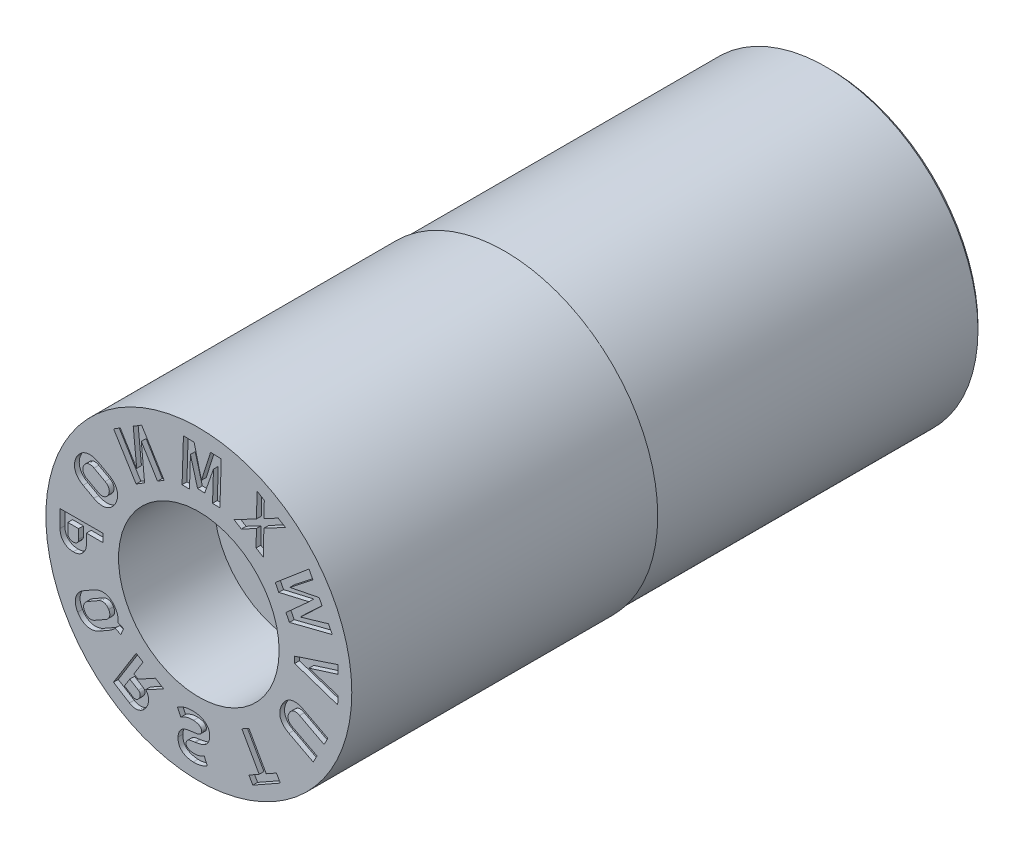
from build123d import *

# Parameters (mm, degrees)
SKETCH4_W          = 17
SKETCH4_H          = 1
CUT_EXTRUDE1_DEPTH = 0.25
CUT_EXTRUDE2_DEPTH = 4


with BuildPart() as part:
    # Sketch1 → Revolve1 (revolve)
    with BuildSketch(Plane(origin=(0, 0, 0), x_dir=(0, 0, -1), z_dir=(1, 0, 0)), mode=Mode.PRIVATE) as revolve1_sk:
        Polygon((0, 8), (0, 4.2), (5, 4.2), (5, 1.75), (25, 1.75), (25, 4), (33, 4), (33, 7.75), (32.75, 8), align=None)
    revolve(revolve1_sk.sketch.rotate(Axis((0, 0, 3.797909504), (0, 0, -1)), 90), axis=Axis((0, 0, 3.797909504), (0, 0, -1)))

    # Sketch4 → Cut-Revolve1 (revolve, cut)
    with BuildSketch(Plane(origin=(0, 0, 0), x_dir=(0, 0, -1), z_dir=(1, 0, 0)), mode=Mode.PRIVATE) as cut_revolve1_sk:
        with Locations((24.5, 8.435)):
            Rectangle(SKETCH4_W, SKETCH4_H)
    revolve(cut_revolve1_sk.sketch.rotate(Axis((0, 0, 0), (0, 0, -1)), 90), axis=Axis((0, 0, 0), (0, 0, -1)), mode=Mode.SUBTRACT)

    # Sketch2 → Cut-Extrude1 (cut)
    # profile 1 of 12: a face of its own
    with BuildSketch(Plane.XY):
        Polygon((6.448754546, 3.151683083), (6.292730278, 3.45458414), (4.760102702, 3.149735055), (5.963079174, 4.094985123), (5.76320825, 4.483422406), (3.998484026, 2.990849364), (4.181338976, 2.635462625), (5.763476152, 3.000881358), (4.555957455, 1.908724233), (4.738812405, 1.553337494), (6.978276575, 2.122844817), (6.778405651, 2.5112821), (5.310107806, 2.080851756), align=None)
    # profile 2 of 12: a face of its own
    with BuildSketch(Plane.XY):
        Polygon((3.156279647, -6.117715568), (2.621254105, -6.419287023), (2.82217294, -6.775881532), (4.261475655, -5.964606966), (4.060556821, -5.608012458), (3.525899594, -5.909376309), (2.620321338, -4.302326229), (2.250802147, -4.51084429), align=None)
    # profile 3 of 12: a face of its own
    with BuildSketch(Plane.XY):
        Polygon((3.400422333, 5.14887687), (4.531800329, 5.749930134), (4.150411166, 5.982356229), (3.408333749, 5.588339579), (3.423618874, 6.425440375), (3.042019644, 6.658274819), (3.018723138, 5.380163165), (1.84224823, 4.756236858), (2.22384746, 4.523402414), (3.010860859, 4.942038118), (2.995108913, 4.053102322), (3.376708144, 3.820267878), align=None)
    # profile 4 of 12: a face of its own
    with BuildSketch(Plane.XY):
        with BuildLine():
            Line((-3.176893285, -4.977699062), (-3.394354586, -4.842178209))
            Line((-3.394354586, -4.842178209), (-2.916705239, -4.075545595))
            Line((-2.916705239, -4.075545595), (-3.275682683, -3.851806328))
            Line((-3.275682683, -3.851806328), (-4.463186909, -5.757764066))
            Line((-4.463186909, -5.757764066), (-3.629212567, -6.277720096))
            add(Edge.make_bspline(
                [(-3.629212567, -6.277720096), (-3.579366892, -6.308192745), (-3.50124317, -6.347048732), (-3.390455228, -6.373239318), (-3.308726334, -6.381238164), (-3.227782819, -6.377355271), (-3.148482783, -6.36164209), (-3.07152402, -6.334571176), (-2.997611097, -6.295599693), (-2.926800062, -6.246575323), (-2.837796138, -6.163751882), (-2.780297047, -6.090431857), (-2.747646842, -6.036315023)],
                knots=[0, 0, 0, 0, 0.170748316, 0.251496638, 0.330740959, 0.409455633, 0.486885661, 0.565662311, 0.646450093, 0.72982964, 0.816027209, 1, 1, 1, 1], degree=3))
            add(Edge.make_bspline(
                [(-2.747646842, -6.036315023), (-2.714781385, -5.982423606), (-2.671434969, -5.899480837), (-2.638108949, -5.782361), (-2.624135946, -5.697139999), (-2.622456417, -5.613312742), (-2.631378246, -5.531928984), (-2.652957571, -5.454059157), (-2.685481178, -5.379711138), (-2.72771268, -5.311465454), (-2.761562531, -5.270255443), (-2.779240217, -5.251415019)],
                knots=[0, 0, 0, 0, 0.184404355, 0.270267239, 0.35397279, 0.435404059, 0.513884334, 0.591753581, 0.669953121, 0.749645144, 0.824899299, 0.824899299, 0.824899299, 0.824899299], degree=3))
            Line((-2.779240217, -5.251415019), (-1.834621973, -4.74981579))
            Line((-1.834621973, -4.74981579), (-2.269640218, -4.478640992))
            Line((-2.269640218, -4.478640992), (-3.176893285, -4.977699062))
        make_face()
        with BuildLine():
            Line((-3.609739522, -5.187873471), (-3.163352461, -5.466016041))
            add(Edge.make_bspline(
                [(-3.163352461, -5.466016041), (-3.145800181, -5.4768042), (-3.121786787, -5.496107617), (-3.097044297, -5.528052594), (-3.083002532, -5.553932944), (-3.072734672, -5.581604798), (-3.065841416, -5.610816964), (-3.064735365, -5.641794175), (-3.066809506, -5.673836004), (-3.073784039, -5.706486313), (-3.087507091, -5.752072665), (-3.104200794, -5.784772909), (-3.117133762, -5.806061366)],
                knots=[0, 0, 0, 0, 0.160612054, 0.237098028, 0.313463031, 0.389060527, 0.466580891, 0.546138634, 0.629588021, 0.716198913, 0.805605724, 1, 1, 1, 1], degree=3))
            add(Edge.make_bspline(
                [(-3.117133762, -5.806061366), (-3.129717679, -5.827405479), (-3.152489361, -5.855740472), (-3.185771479, -5.88946938), (-3.21234139, -5.909579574), (-3.240003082, -5.925553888), (-3.268125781, -5.938236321), (-3.297355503, -5.945494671), (-3.326744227, -5.948729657), (-3.356407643, -5.946866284), (-3.396414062, -5.93848117), (-3.424753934, -5.924977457), (-3.442466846, -5.913810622)],
                knots=[0, 0, 0, 0, 0.191933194, 0.281905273, 0.36782532, 0.450097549, 0.529993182, 0.606814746, 0.683303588, 0.759047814, 0.836940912, 1, 1, 1, 1], degree=3))
            Line((-3.442466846, -5.913810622), (-3.888769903, -5.635720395))
            Line((-3.888769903, -5.635720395), (-3.609739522, -5.187873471))
        make_face(mode=Mode.SUBTRACT)
    # profile 5 of 12: a face of its own
    with BuildSketch(Plane.XY):
        Polygon((-0.245141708, 7.220416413), (-0.804769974, 7.237854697), (-0.874340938, 4.985077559), (-0.488230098, 4.973391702), (-0.438783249, 6.571851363), (-0.065302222, 5.211328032), (0.309778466, 5.19975263), (0.765980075, 6.508322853), (0.717338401, 4.935891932), (1.102990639, 4.924229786), (1.172561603, 7.177006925), (0.613368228, 7.193962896), (0.137357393, 5.689187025), align=None)
    # profile 6 of 12: a face of its own
    with BuildSketch(Plane.XY):
        with BuildLine():
            Line((-5.879741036, 0.288959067), (-5.005414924, 0.290744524))
            Line((-5.005414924, 0.290744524), (-5.006376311, 0.71551886))
            Line((-5.006376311, 0.71551886), (-7.259749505, 0.710917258))
            Line((-7.259749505, 0.710917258), (-7.257987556, -0.192820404))
            add(Edge.make_bspline(
                [(-7.257987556, -0.192820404), (-7.258290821, -0.259485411), (-7.247448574, -0.357278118), (-7.211422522, -0.480537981), (-7.173532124, -0.563868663), (-7.125738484, -0.639549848), (-7.06903602, -0.70704663), (-7.003075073, -0.765047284), (-6.929071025, -0.814037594), (-6.847204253, -0.852638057), (-6.726663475, -0.890354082), (-6.630288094, -0.899112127), (-6.565264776, -0.899421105)],
                knots=[0, 0, 0, 0, 0.179427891, 0.26319197, 0.344951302, 0.425148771, 0.503595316, 0.581560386, 0.660921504, 0.741878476, 0.824547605, 1, 1, 1, 1], degree=3))
            add(Edge.make_bspline(
                [(-6.565264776, -0.899421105), (-6.500260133, -0.899222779), (-6.4041722, -0.889858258), (-6.284298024, -0.851423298), (-6.203396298, -0.812166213), (-6.129713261, -0.763391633), (-6.064142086, -0.705325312), (-6.007988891, -0.637480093), (-5.961210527, -0.561221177), (-5.923870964, -0.477540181), (-5.887488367, -0.354339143), (-5.878804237, -0.256216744), (-5.878962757, -0.189818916)],
                knots=[0, 0, 0, 0, 0.175670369, 0.257978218, 0.338538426, 0.417594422, 0.495742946, 0.574022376, 0.654372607, 0.736457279, 0.820616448, 1, 1, 1, 1], degree=3))
            Line((-5.878962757, -0.189818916), (-5.879741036, 0.288959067))
        make_face()
        with BuildLine():
            Line((-6.28888924, 0.288123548), (-6.288065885, -0.201256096))
            add(Edge.make_bspline(
                [(-6.288065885, -0.201256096), (-6.28811712, -0.225317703), (-6.29160305, -0.261103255), (-6.30635888, -0.305632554), (-6.321582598, -0.33597866), (-6.340687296, -0.363660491), (-6.363593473, -0.388253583), (-6.390327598, -0.409452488), (-6.420357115, -0.427320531), (-6.45341484, -0.441800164), (-6.501866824, -0.455813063), (-6.540281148, -0.45950966), (-6.566309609, -0.459492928)],
                knots=[0, 0, 0, 0, 0.169434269, 0.250085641, 0.328531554, 0.407345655, 0.485754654, 0.563904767, 0.646401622, 0.730758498, 0.816935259, 1, 1, 1, 1], degree=3))
            add(Edge.make_bspline(
                [(-6.566309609, -0.459492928), (-6.59263734, -0.459791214), (-6.631548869, -0.456536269), (-6.680751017, -0.443036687), (-6.714342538, -0.429056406), (-6.744663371, -0.411392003), (-6.771637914, -0.390504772), (-6.794803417, -0.366155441), (-6.814323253, -0.338598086), (-6.829775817, -0.308238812), (-6.844425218, -0.263111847), (-6.848481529, -0.227045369), (-6.84876811, -0.202506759)],
                knots=[0, 0, 0, 0, 0.183737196, 0.270259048, 0.354930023, 0.436774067, 0.514305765, 0.592094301, 0.670284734, 0.749063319, 0.828741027, 1, 1, 1, 1], degree=3))
            Line((-6.84876811, -0.202506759), (-6.849591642, 0.28697854))
            Line((-6.849591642, 0.28697854), (-6.28888924, 0.288123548))
        make_face(mode=Mode.SUBTRACT)
    # profile 7 of 12: a face of its own
    with BuildSketch(Plane.XY):
        Polygon((-2.989519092, 6.623957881), (-3.430480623, 6.353029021), (-3.24985543, 4.534367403), (-4.110336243, 5.935151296), (-4.455080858, 5.723065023), (-3.280328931, 3.811320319), (-2.836850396, 4.084025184), (-3.006866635, 5.879968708), (-2.15929458, 4.500531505), (-1.814767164, 4.712213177), align=None)
    # profile 8 of 12: a face of its own
    with BuildSketch(Plane.XY):
        with BuildLine():
            Line((-4.697997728, 3.50761804), (-5.259273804, 3.815458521))
            add(Edge.make_bspline(
                [(-5.259273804, 3.815458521), (-5.294785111, 3.834386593), (-5.348108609, 3.861485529), (-5.421785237, 3.888528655), (-5.47591246, 3.90572524), (-5.53009647, 3.918898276), (-5.584171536, 3.92872064), (-5.638158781, 3.933946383), (-5.691819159, 3.936536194), (-5.744886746, 3.934170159), (-5.797141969, 3.929852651), (-5.848233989, 3.920364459), (-5.898340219, 3.908007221), (-5.947513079, 3.892088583), (-5.995306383, 3.872142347), (-6.042475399, 3.849473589), (-6.088007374, 3.822324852), (-6.131911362, 3.791944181), (-6.174611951, 3.758936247), (-6.214770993, 3.722131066), (-6.253216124, 3.682306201), (-6.289625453, 3.63932919), (-6.336111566, 3.577140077), (-6.367075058, 3.526955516), (-6.386178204, 3.492126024)],
                knots=[0, 0, 0, 0, 0.091509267, 0.135459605, 0.178154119, 0.220454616, 0.262041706, 0.302877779, 0.343583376, 0.383954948, 0.42345463, 0.462585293, 0.501839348, 0.540633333, 0.579850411, 0.619400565, 0.659411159, 0.700116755, 0.740631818, 0.781903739, 0.823734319, 0.866298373, 0.909761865, 1, 1, 1, 1], degree=3))
            add(Edge.make_bspline(
                [(-6.386178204, 3.492126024), (-6.405624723, 3.457356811), (-6.43099495, 3.404032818), (-6.458416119, 3.331348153), (-6.474776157, 3.277540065), (-6.488332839, 3.223990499), (-6.496813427, 3.170117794), (-6.502538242, 3.116480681), (-6.504253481, 3.062882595), (-6.50257681, 3.009861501), (-6.496413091, 2.95779221), (-6.48752227, 2.9068268), (-6.474770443, 2.856873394), (-6.458283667, 2.808009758), (-6.437930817, 2.760321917), (-6.41484768, 2.713221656), (-6.386996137, 2.667987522), (-6.356905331, 2.623453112), (-6.322407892, 2.581512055), (-6.285807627, 2.540486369), (-6.245054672, 2.502294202), (-6.202027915, 2.465146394), (-6.138715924, 2.418640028), (-6.087874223, 2.387394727), (-6.052601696, 2.36795257)],
                knots=[0, 0, 0, 0, 0.090427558, 0.133878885, 0.176295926, 0.218093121, 0.259200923, 0.300025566, 0.340521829, 0.380882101, 0.420369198, 0.459488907, 0.49829228, 0.537326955, 0.57647291, 0.615973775, 0.656310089, 0.697004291, 0.737925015, 0.779528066, 0.821766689, 0.864651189, 0.908550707, 1, 1, 1, 1], degree=3))
            Line((-6.052601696, 2.36795257), (-5.49132562, 2.060112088))
            add(Edge.make_bspline(
                [(-5.49132562, 2.060112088), (-5.455799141, 2.041234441), (-5.402520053, 2.013987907), (-5.328662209, 1.987139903), (-5.274718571, 1.969307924), (-5.22036032, 1.956772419), (-5.166222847, 1.946830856), (-5.112017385, 1.941398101), (-5.058213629, 1.939205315), (-5.005062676, 1.940139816), (-4.95287721, 1.945994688), (-4.901668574, 1.954475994), (-4.851460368, 1.966827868), (-4.802376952, 1.982980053), (-4.754349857, 2.0027356), (-4.707413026, 2.026187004), (-4.661680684, 2.053231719), (-4.617671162, 2.083743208), (-4.574965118, 2.116739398), (-4.534807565, 2.153547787), (-4.496362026, 2.193371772), (-4.459952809, 2.236349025), (-4.413466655, 2.29853805), (-4.382503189, 2.348722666), (-4.363400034, 2.383552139)],
                knots=[0, 0, 0, 0, 0.091418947, 0.135325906, 0.178244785, 0.220252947, 0.261798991, 0.30308282, 0.34374824, 0.383960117, 0.423573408, 0.462799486, 0.501685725, 0.540777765, 0.579956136, 0.619429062, 0.659747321, 0.700412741, 0.740887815, 0.782119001, 0.823908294, 0.866430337, 0.90985093, 1, 1, 1, 1], degree=3))
            add(Edge.make_bspline(
                [(-4.363400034, 2.383552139), (-4.343969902, 2.418324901), (-4.318551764, 2.471638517), (-4.29120702, 2.544339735), (-4.274671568, 2.597997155), (-4.26186467, 2.651700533), (-4.252500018, 2.705324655), (-4.247618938, 2.759063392), (-4.245572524, 2.812339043), (-4.247755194, 2.865199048), (-4.253195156, 2.917183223), (-4.262014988, 2.968374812), (-4.275896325, 3.018156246), (-4.29151567, 3.067422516), (-4.311935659, 3.115328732), (-4.336026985, 3.162035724), (-4.362849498, 3.208070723), (-4.394031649, 3.251841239), (-4.427527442, 3.294588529), (-4.464948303, 3.334913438), (-4.505496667, 3.373318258), (-4.548584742, 3.410412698), (-4.611874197, 3.456938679), (-4.662730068, 3.488171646), (-4.697997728, 3.50761804)],
                knots=[0, 0, 0, 0, 0.090417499, 0.133863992, 0.176276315, 0.217818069, 0.259154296, 0.299759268, 0.340251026, 0.380131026, 0.419767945, 0.458883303, 0.497905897, 0.537021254, 0.576162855, 0.615970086, 0.656312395, 0.697015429, 0.737894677, 0.779552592, 0.821786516, 0.864666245, 0.90856088, 1, 1, 1, 1], degree=3))
        make_face()
        with BuildLine():
            Line((-5.269265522, 2.441782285), (-5.850213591, 2.759941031))
            add(Edge.make_bspline(
                [(-5.850213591, 2.759941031), (-5.883017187, 2.777573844), (-5.928108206, 2.809167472), (-5.979620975, 2.859515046), (-6.010455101, 2.900708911), (-6.03596789, 2.943896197), (-6.05343316, 2.989902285), (-6.064816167, 3.037543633), (-6.068268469, 3.086862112), (-6.065179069, 3.13714564), (-6.052028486, 3.206248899), (-6.029980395, 3.255593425), (-6.012958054, 3.287554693)],
                knots=[0, 0, 0, 0, 0.179291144, 0.26398396, 0.346173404, 0.426702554, 0.505006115, 0.582502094, 0.662078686, 0.742384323, 0.824864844, 1, 1, 1, 1], degree=3))
            add(Edge.make_bspline(
                [(-6.012958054, 3.287554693), (-5.995630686, 3.319393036), (-5.964836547, 3.363428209), (-5.914442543, 3.412262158), (-5.874082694, 3.442128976), (-5.830328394, 3.464991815), (-5.784371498, 3.481390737), (-5.735974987, 3.490495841), (-5.68589272, 3.493014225), (-5.634567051, 3.488864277), (-5.56454696, 3.472200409), (-5.5134419, 3.45206528), (-5.481086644, 3.43340136)],
                knots=[0, 0, 0, 0, 0.175013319, 0.257188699, 0.337905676, 0.416521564, 0.494677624, 0.572623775, 0.653377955, 0.736149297, 0.820281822, 1, 1, 1, 1], degree=3))
            Line((-5.481086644, 3.43340136), (-4.900138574, 3.115242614))
            add(Edge.make_bspline(
                [(-4.900138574, 3.115242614), (-4.867314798, 3.097362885), (-4.822270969, 3.06576403), (-4.770613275, 3.015576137), (-4.739903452, 2.974467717), (-4.714385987, 2.931288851), (-4.696906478, 2.885282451), (-4.685632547, 2.837836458), (-4.68191057, 2.788761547), (-4.684934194, 2.738536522), (-4.698925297, 2.669641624), (-4.719840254, 2.619985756), (-4.737254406, 2.588263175)],
                knots=[0, 0, 0, 0, 0.180158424, 0.264225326, 0.346506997, 0.427126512, 0.50551794, 0.583100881, 0.661766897, 0.742162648, 0.825246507, 1, 1, 1, 1], degree=3))
            add(Edge.make_bspline(
                [(-4.737254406, 2.588263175), (-4.755450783, 2.557071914), (-4.784563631, 2.511567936), (-4.83594097, 2.463687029), (-4.876209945, 2.43353756), (-4.920158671, 2.410803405), (-4.965956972, 2.39363669), (-5.014393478, 2.384708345), (-5.064360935, 2.382251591), (-5.115714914, 2.38596505), (-5.185983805, 2.401975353), (-5.236862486, 2.42328494), (-5.269265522, 2.441782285)],
                knots=[0, 0, 0, 0, 0.17506645, 0.257026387, 0.337672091, 0.416954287, 0.4948771, 0.572754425, 0.6534373, 0.735689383, 0.820268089, 1, 1, 1, 1], degree=3))
        make_face(mode=Mode.SUBTRACT)
    # profile 9 of 12: a face of its own
    with BuildSketch(Plane.XY):
        with BuildLine():
            Line((-4.384810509, -3.27268981), (-4.073990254, -3.405276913))
            Line((-4.073990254, -3.405276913), (-3.936350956, -3.066934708))
            Line((-3.936350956, -3.066934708), (-4.23235892, -2.941079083))
            add(Edge.make_bspline(
                [(-4.23235892, -2.941079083), (-4.230362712, -2.929627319), (-4.226086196, -2.900918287), (-4.222100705, -2.854534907), (-4.220850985, -2.801813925), (-4.223670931, -2.74879925), (-4.229943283, -2.695618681), (-4.239981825, -2.642497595), (-4.253722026, -2.589228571), (-4.271060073, -2.53599301), (-4.299582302, -2.464261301), (-4.325737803, -2.411869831), (-4.345657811, -2.377742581)],
                knots=[0.553251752, 0.553251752, 0.553251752, 0.553251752, 0.579811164, 0.619551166, 0.659567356, 0.700234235, 0.740773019, 0.781862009, 0.823684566, 0.866414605, 0.909726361, 1, 1, 1, 1], degree=3))
            add(Edge.make_bspline(
                [(-4.345657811, -2.377742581), (-4.365118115, -2.343379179), (-4.397334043, -2.294414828), (-4.444015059, -2.233060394), (-4.481068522, -2.191098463), (-4.519998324, -2.152454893), (-4.560786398, -2.116795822), (-4.60348107, -2.084405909), (-4.647850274, -2.05523024), (-4.693741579, -2.029671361), (-4.740463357, -2.007051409), (-4.78831226, -1.988197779), (-4.837410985, -1.973208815), (-4.887321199, -1.961460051), (-4.938550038, -1.954055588), (-4.990530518, -1.949833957), (-5.043397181, -1.949225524), (-5.09672561, -1.951579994), (-5.150154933, -1.959194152), (-5.203852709, -1.968907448), (-5.257438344, -1.983270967), (-5.310931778, -2.000931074), (-5.383237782, -2.030154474), (-5.43620992, -2.056612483), (-5.470926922, -2.076605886)],
                knots=[0, 0, 0, 0, 0.090234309, 0.133860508, 0.176166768, 0.218113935, 0.259198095, 0.299946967, 0.340551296, 0.380504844, 0.419966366, 0.459160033, 0.497959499, 0.537253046, 0.576271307, 0.616191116, 0.656407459, 0.697093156, 0.738095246, 0.779697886, 0.821795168, 0.864814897, 0.908429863, 1, 1, 1, 1], degree=3))
            Line((-5.470926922, -2.076605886), (-6.023576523, -2.391827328))
            add(Edge.make_bspline(
                [(-6.023576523, -2.391827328), (-6.058206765, -2.411841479), (-6.108292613, -2.443678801), (-6.169953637, -2.491399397), (-6.212626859, -2.528405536), (-6.251871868, -2.567519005), (-6.28817002, -2.608437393), (-6.321111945, -2.651148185), (-6.35079727, -2.695546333), (-6.377109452, -2.741374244), (-6.399597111, -2.788455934), (-6.419244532, -2.836270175), (-6.434202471, -2.885326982), (-6.445992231, -2.935162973), (-6.454853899, -2.985917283), (-6.459123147, -3.03777671), (-6.460420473, -3.090489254), (-6.457597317, -3.143508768), (-6.45128921, -3.196678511), (-6.441418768, -3.249735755), (-6.427143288, -3.302756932), (-6.409990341, -3.355932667), (-6.381412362, -3.427649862), (-6.355291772, -3.48005042), (-6.335359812, -3.514174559)],
                knots=[0, 0, 0, 0, 0.091459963, 0.135406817, 0.178140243, 0.220498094, 0.261975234, 0.303096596, 0.343701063, 0.383980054, 0.423781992, 0.462904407, 0.502034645, 0.540875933, 0.579932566, 0.619683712, 0.659711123, 0.700389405, 0.740939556, 0.782040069, 0.823635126, 0.866377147, 0.909701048, 1, 1, 1, 1], degree=3))
            add(Edge.make_bspline(
                [(-6.335359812, -3.514174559), (-6.315914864, -3.548552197), (-6.283653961, -3.597474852), (-6.236956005, -3.659013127), (-6.199695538, -3.700781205), (-6.160971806, -3.739633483), (-6.120107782, -3.774985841), (-6.077898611, -3.808029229), (-6.03325118, -3.83711317), (-5.987280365, -3.862825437), (-5.940409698, -3.885500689), (-5.892558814, -3.904334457), (-5.843617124, -3.919370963), (-5.793641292, -3.930791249), (-5.742675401, -3.938479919), (-5.690777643, -3.942865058), (-5.638005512, -3.943654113), (-5.58464497, -3.94034508), (-5.531051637, -3.934117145), (-5.477432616, -3.923675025), (-5.424092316, -3.908956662), (-5.370250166, -3.891710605), (-5.297828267, -3.862671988), (-5.245148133, -3.835304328), (-5.210335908, -3.815699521)],
                knots=[0, 0, 0, 0, 0.09021845, 0.133836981, 0.176471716, 0.218069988, 0.259146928, 0.299920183, 0.340517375, 0.380813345, 0.420267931, 0.45945471, 0.498247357, 0.537203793, 0.576535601, 0.615976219, 0.656185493, 0.697066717, 0.738109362, 0.77944927, 0.821795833, 0.864538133, 0.908634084, 1, 1, 1, 1], degree=3))
            Line((-5.210335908, -3.815699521), (-4.657686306, -3.500478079))
            add(Edge.make_bspline(
                [(-4.657686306, -3.500478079), (-4.623042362, -3.480479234), (-4.572996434, -3.448597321), (-4.511155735, -3.400857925), (-4.468665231, -3.363650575), (-4.429255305, -3.32471271), (-4.40199631, -3.293908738), (-4.38766683, -3.276268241), (-4.384810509, -3.27268981)],
                knots=[0, 0, 0, 0, 0.091434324, 0.135368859, 0.178425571, 0.22043061, 0.261896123, 0.272357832, 0.272357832, 0.272357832, 0.272357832], degree=3))
        make_face()
        with BuildLine():
            Line((-4.865722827, -3.11436888), (-5.437212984, -3.440503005))
            add(Edge.make_bspline(
                [(-5.437212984, -3.440503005), (-5.469151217, -3.459239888), (-5.519204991, -3.481300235), (-5.588803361, -3.498296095), (-5.639666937, -3.503329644), (-5.689489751, -3.50228612), (-5.737457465, -3.493281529), (-5.783527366, -3.478002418), (-5.827236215, -3.455656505), (-5.868329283, -3.427141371), (-5.918882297, -3.378953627), (-5.950711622, -3.336038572), (-5.968275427, -3.304442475)],
                knots=[0, 0, 0, 0, 0.179630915, 0.263715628, 0.346819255, 0.427114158, 0.504808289, 0.582853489, 0.661977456, 0.742323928, 0.824817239, 1, 1, 1, 1], degree=3))
            add(Edge.make_bspline(
                [(-5.968275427, -3.304442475), (-5.986668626, -3.273443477), (-6.007063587, -3.224345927), (-6.023016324, -3.15652976), (-6.026729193, -3.10674933), (-6.023998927, -3.057661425), (-6.013358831, -3.010175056), (-5.996611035, -2.964162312), (-5.972568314, -2.920429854), (-5.942238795, -2.879307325), (-5.892391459, -2.827904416), (-5.847532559, -2.796466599), (-5.815540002, -2.777936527)],
                knots=[0, 0, 0, 0, 0.174597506, 0.25660398, 0.337340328, 0.416192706, 0.494507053, 0.572807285, 0.65326591, 0.73600039, 0.82027371, 1, 1, 1, 1], degree=3))
            Line((-5.815540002, -2.777936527), (-5.244049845, -2.451802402))
            add(Edge.make_bspline(
                [(-5.244049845, -2.451802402), (-5.212050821, -2.432903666), (-5.161719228, -2.411399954), (-5.092289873, -2.394245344), (-5.041625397, -2.389410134), (-4.991863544, -2.390340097), (-4.943965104, -2.39968285), (-4.897838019, -2.414704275), (-4.854242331, -2.437019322), (-4.813333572, -2.465667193), (-4.762026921, -2.512824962), (-4.731612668, -2.556770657), (-4.71337567, -2.587617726)],
                knots=[0, 0, 0, 0, 0.18033837, 0.264552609, 0.346739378, 0.427157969, 0.505662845, 0.583105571, 0.662351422, 0.742821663, 0.82530448, 1, 1, 1, 1], degree=3))
            add(Edge.make_bspline(
                [(-4.71337567, -2.587617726), (-4.695620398, -2.618961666), (-4.673710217, -2.667825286), (-4.658663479, -2.736086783), (-4.654672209, -2.785951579), (-4.657764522, -2.834884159), (-4.667167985, -2.88253271), (-4.684886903, -2.928098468), (-4.70855135, -2.971764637), (-4.738885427, -3.012737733), (-4.788841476, -3.063978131), (-4.833165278, -3.09635069), (-4.865722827, -3.11436888)],
                knots=[0, 0, 0, 0, 0.175070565, 0.257562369, 0.338257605, 0.417069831, 0.494905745, 0.573014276, 0.653431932, 0.735383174, 0.819613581, 1, 1, 1, 1], degree=3))
        make_face(mode=Mode.SUBTRACT)
    # profile 10 of 12: a face of its own
    with BuildSketch(Plane.XY):
        with BuildLine():
            Line((-1.116430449, -5.214817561), (-0.939987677, -5.576081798))
            add(Edge.make_bspline(
                [(-0.939987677, -5.576081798), (-0.894474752, -5.542530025), (-0.820612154, -5.49907573), (-0.714600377, -5.454243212), (-0.630352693, -5.427345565), (-0.543482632, -5.406968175), (-0.425873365, -5.388408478), (-0.336425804, -5.387261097), (-0.277163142, -5.3901562)],
                knots=[0, 0, 0, 0, 0.241564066, 0.364850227, 0.491535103, 0.619245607, 0.746087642, 1, 1, 1, 1], degree=3))
            add(Edge.make_bspline(
                [(-0.277163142, -5.3901562), (-0.244538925, -5.392705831), (-0.19670238, -5.396227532), (-0.135878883, -5.407912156), (-0.094322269, -5.417448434), (-0.055980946, -5.429699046), (-0.020747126, -5.444205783), (0.011869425, -5.45983487), (0.04084953, -5.478356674), (0.067052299, -5.498038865), (0.089066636, -5.520215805), (0.107892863, -5.543568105), (0.122861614, -5.568686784), (0.133785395, -5.595420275), (0.144374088, -5.633740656), (0.145559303, -5.664207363), (0.14434213, -5.684603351)],
                knots=[0, 0, 0, 0, 0.170713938, 0.249202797, 0.322516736, 0.392760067, 0.458609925, 0.520966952, 0.580889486, 0.63753242, 0.691347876, 0.743243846, 0.793495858, 0.843085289, 0.893305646, 1, 1, 1, 1], degree=3))
            Line((0.14434213, -5.684603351), (0.14421534, -5.685975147))
            add(Edge.make_bspline(
                [(0.14421534, -5.685975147), (0.142533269, -5.713245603), (0.134961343, -5.753038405), (0.110234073, -5.799057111), (0.085703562, -5.82677577), (0.056567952, -5.849861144), (0.023533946, -5.868927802), (-0.012859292, -5.884714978), (-0.0534713, -5.896484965), (-0.098679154, -5.9061142), (-0.169808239, -5.917161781), (-0.226044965, -5.92452506), (-0.265541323, -5.928034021)],
                knots=[0, 0, 0, 0, 0.155957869, 0.226204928, 0.294878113, 0.365125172, 0.43693804, 0.511413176, 0.590371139, 0.677174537, 0.774386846, 1, 1, 1, 1], degree=3))
            add(Edge.make_bspline(
                [(-0.265541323, -5.928034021), (-0.268471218, -5.928633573), (-0.274346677, -5.930025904), (-0.28035, -5.929368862), (-0.283255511, -5.930086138)],
                knots=[0, 0, 0, 0, 0.505222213, 1, 1, 1, 1], degree=3))
            Line((-0.283255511, -5.930086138), (-0.3171853, -5.932945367))
            add(Edge.make_bspline(
                [(-0.3171853, -5.932945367), (-0.387104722, -5.940553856), (-0.487647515, -5.952367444), (-0.613854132, -5.978207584), (-0.695960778, -5.998891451), (-0.771240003, -6.026448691), (-0.840269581, -6.065251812), (-0.90399844, -6.114217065), (-0.952530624, -6.162896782), (-0.987257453, -6.207635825), (-1.01051842, -6.245415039), (-1.031158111, -6.286637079), (-1.047961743, -6.331838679), (-1.062162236, -6.380616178), (-1.077655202, -6.452517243), (-1.083144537, -6.509042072), (-1.085591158, -6.547686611)],
                knots=[0, 0, 0, 0, 0.190739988, 0.273950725, 0.349023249, 0.420087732, 0.490513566, 0.562739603, 0.637321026, 0.676108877, 0.715999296, 0.757372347, 0.800854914, 0.84650037, 0.894974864, 1, 1, 1, 1], degree=3))
            Line((-1.085591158, -6.547686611), (-1.085760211, -6.549515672))
            add(Edge.make_bspline(
                [(-1.085760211, -6.549515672), (-1.087928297, -6.584655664), (-1.088346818, -6.636712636), (-1.081302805, -6.704612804), (-1.073307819, -6.752942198), (-1.062620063, -6.799696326), (-1.048144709, -6.844408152), (-1.03085971, -6.88741358), (-1.010185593, -6.928434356), (-0.986549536, -6.967648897), (-0.9600098, -7.004601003), (-0.930713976, -7.039575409), (-0.898085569, -7.071828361), (-0.862945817, -7.102690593), (-0.824463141, -7.130819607), (-0.783534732, -7.157512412), (-0.739435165, -7.181126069), (-0.692947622, -7.203210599), (-0.643640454, -7.222272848), (-0.591811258, -7.239228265), (-0.537456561, -7.253204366), (-0.480586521, -7.265395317), (-0.399957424, -7.279388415), (-0.337509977, -7.284202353), (-0.295233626, -7.287129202)],
                knots=[0, 0, 0, 0, 0.086122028, 0.126937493, 0.166794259, 0.205855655, 0.244094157, 0.281594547, 0.319089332, 0.356297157, 0.393446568, 0.430237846, 0.467715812, 0.505528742, 0.54449497, 0.584173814, 0.624918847, 0.666716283, 0.709957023, 0.754089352, 0.79999564, 0.847120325, 0.896297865, 1, 1, 1, 1], degree=3))
            add(Edge.make_bspline(
                [(-0.295233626, -7.287129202), (-0.254557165, -7.289638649), (-0.192699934, -7.289683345), (-0.109887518, -7.282504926), (-0.025100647, -7.271418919), (0.080824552, -7.248419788), (0.247319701, -7.195705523), (0.365989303, -7.138085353), (0.441191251, -7.093248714)],
                knots=[0, 0, 0, 0, 0.158254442, 0.23976924, 0.322693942, 0.49022785, 0.659934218, 1, 1, 1, 1], degree=3))
            Line((0.441191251, -7.093248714), (0.282097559, -6.723903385))
            add(Edge.make_bspline(
                [(0.282097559, -6.723903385), (0.238139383, -6.751462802), (0.169299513, -6.786688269), (0.074617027, -6.825268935), (0.003521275, -6.848766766), (-0.067529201, -6.866008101), (-0.158989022, -6.881492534), (-0.227461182, -6.883843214), (-0.272048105, -6.881596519)],
                knots=[0, 0, 0, 0, 0.266014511, 0.396017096, 0.524443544, 0.64990441, 0.77090048, 1, 1, 1, 1], degree=3))
            add(Edge.make_bspline(
                [(-0.272048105, -6.881596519), (-0.30277675, -6.879706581), (-0.347300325, -6.875110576), (-0.404667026, -6.865862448), (-0.443289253, -6.856086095), (-0.479256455, -6.845041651), (-0.512506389, -6.832295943), (-0.542938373, -6.817743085), (-0.570106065, -6.80072305), (-0.594368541, -6.782487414), (-0.615179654, -6.762641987), (-0.632599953, -6.741219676), (-0.646609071, -6.71843809), (-0.657006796, -6.693977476), (-0.666292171, -6.65908521), (-0.668005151, -6.631590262), (-0.666901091, -6.613132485)],
                knots=[0, 0, 0, 0, 0.172994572, 0.251527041, 0.3263666, 0.396739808, 0.462927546, 0.526373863, 0.586018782, 0.642841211, 0.696727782, 0.747231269, 0.797654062, 0.846548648, 0.896097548, 1, 1, 1, 1], degree=3))
            Line((-0.666901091, -6.613132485), (-0.666774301, -6.611760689))
            add(Edge.make_bspline(
                [(-0.666774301, -6.611760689), (-0.664578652, -6.582412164), (-0.657823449, -6.538733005), (-0.629581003, -6.48958836), (-0.602757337, -6.460122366), (-0.571715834, -6.435292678), (-0.53707197, -6.415043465), (-0.499805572, -6.397814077), (-0.458079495, -6.385059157), (-0.410970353, -6.374313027), (-0.333138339, -6.358876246), (-0.270196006, -6.350149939), (-0.225547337, -6.343556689)],
                knots=[0, 0, 0, 0, 0.156636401, 0.226716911, 0.295979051, 0.365625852, 0.435538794, 0.50712797, 0.581642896, 0.665116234, 0.761920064, 1, 1, 1, 1], degree=3))
            add(Edge.make_bspline(
                [(-0.225547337, -6.343556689), (-0.22158427, -6.342446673), (-0.21318247, -6.342946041), (-0.204991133, -6.341069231), (-0.200805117, -6.340309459)],
                knots=[0, 0, 0, 0, 0.487223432, 1, 1, 1, 1], degree=3))
            add(Edge.make_bspline(
                [(-0.200805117, -6.340309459), (-0.19469791, -6.339824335), (-0.182426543, -6.338274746), (-0.170516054, -6.334935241), (-0.164293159, -6.33446069)],
                knots=[0, 0, 0, 0, 0.496913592, 1, 1, 1, 1], degree=3))
            add(Edge.make_bspline(
                [(-0.164293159, -6.33446069), (-0.097840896, -6.325024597), (-0.002289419, -6.309244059), (0.11783789, -6.278915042), (0.196812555, -6.255458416), (0.269307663, -6.224970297), (0.335053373, -6.184400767), (0.395640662, -6.13496849), (0.440860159, -6.086367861), (0.473229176, -6.042310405), (0.495014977, -6.005566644), (0.513916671, -5.965617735), (0.529880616, -5.922649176), (0.542748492, -5.876459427), (0.557273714, -5.808970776), (0.562823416, -5.756011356), (0.564907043, -5.719785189)],
                knots=[0, 0, 0, 0, 0.189524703, 0.272869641, 0.349567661, 0.42186792, 0.494099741, 0.56680542, 0.641979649, 0.680728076, 0.720921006, 0.762332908, 0.805299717, 0.850122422, 0.897544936, 1, 1, 1, 1], degree=3))
            Line((0.564907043, -5.719785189), (0.56474562, -5.716542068))
            add(Edge.make_bspline(
                [(0.56474562, -5.716542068), (0.566882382, -5.681850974), (0.56713014, -5.630417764), (0.56022472, -5.56321581), (0.551688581, -5.515467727), (0.540268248, -5.469343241), (0.525549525, -5.425023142), (0.507035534, -5.382664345), (0.486081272, -5.341764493), (0.461347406, -5.303093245), (0.433796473, -5.266286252), (0.403193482, -5.231591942), (0.36981891, -5.198863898), (0.333103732, -5.168755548), (0.293574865, -5.140451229), (0.250805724, -5.114660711), (0.205458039, -5.090368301), (0.156926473, -5.069028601), (0.105968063, -5.049523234), (0.052197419, -5.03269614), (-0.003892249, -5.01756384), (-0.062940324, -5.006061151), (-0.146212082, -4.992454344), (-0.210420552, -4.98706514), (-0.253935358, -4.984166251)],
                knots=[0, 0, 0, 0, 0.083788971, 0.123659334, 0.16268594, 0.200610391, 0.238110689, 0.275095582, 0.311940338, 0.348766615, 0.385598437, 0.422660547, 0.460173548, 0.49814105, 0.536996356, 0.577259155, 0.618441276, 0.660912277, 0.704955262, 0.749897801, 0.796664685, 0.844907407, 0.894828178, 1, 1, 1, 1], degree=3))
            add(Edge.make_bspline(
                [(-0.253935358, -4.984166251), (-0.307181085, -4.980576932), (-0.386850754, -4.980693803), (-0.492507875, -4.988209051), (-0.570588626, -4.9978674), (-0.647215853, -5.012143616), (-0.722133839, -5.029459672), (-0.7947374, -5.051549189), (-0.865208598, -5.077109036), (-0.932908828, -5.106523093), (-1.018692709, -5.148768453), (-1.078647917, -5.187145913), (-1.116430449, -5.214817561)],
                knots=[0, 0, 0, 0, 0.175815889, 0.26225255, 0.349053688, 0.434998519, 0.519088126, 0.602386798, 0.684996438, 0.766059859, 0.84559342, 1, 1, 1, 1], degree=3))
        make_face()
    # profile 11 of 12: a face of its own
    with BuildSketch(Plane.XY):
        with BuildLine():
            Line((4.711925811, -3.482521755), (5.983657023, -4.15082079))
            Line((5.983657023, -4.15082079), (6.181081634, -3.775385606))
            Line((6.181081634, -3.775385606), (4.899735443, -3.102367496))
            add(Edge.make_bspline(
                [(4.899735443, -3.102367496), (4.872620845, -3.088144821), (4.834431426, -3.064611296), (4.789023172, -3.028132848), (4.758978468, -3.000543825), (4.734193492, -2.969846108), (4.712371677, -2.938372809), (4.694770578, -2.905158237), (4.681169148, -2.870487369), (4.67150099, -2.834614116), (4.666526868, -2.797781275), (4.665421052, -2.760258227), (4.668886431, -2.722004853), (4.675782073, -2.682782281), (4.691978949, -2.628213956), (4.709479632, -2.588126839), (4.723442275, -2.561757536)],
                knots=[0, 0, 0, 0, 0.142153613, 0.207298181, 0.27018435, 0.330981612, 0.38995884, 0.44771269, 0.504970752, 0.562479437, 0.619684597, 0.677065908, 0.736316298, 0.797630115, 0.861582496, 1, 1, 1, 1], degree=3))
            add(Edge.make_bspline(
                [(4.723442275, -2.561757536), (4.737369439, -2.535267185), (4.760385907, -2.497606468), (4.796689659, -2.453238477), (4.824622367, -2.424342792), (4.854874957, -2.400160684), (4.88621195, -2.378878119), (4.919877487, -2.362276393), (4.954875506, -2.349403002), (4.991174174, -2.34078818), (5.028473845, -2.336603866), (5.066721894, -2.336047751), (5.105901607, -2.339769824), (5.145785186, -2.348284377), (5.201729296, -2.364814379), (5.24278543, -2.383099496), (5.269742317, -2.397644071)],
                knots=[0, 0, 0, 0, 0.138457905, 0.203137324, 0.264775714, 0.323858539, 0.381893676, 0.439569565, 0.496910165, 0.553988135, 0.611590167, 0.670102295, 0.730559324, 0.793113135, 0.858359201, 1, 1, 1, 1], degree=3))
            Line((5.269742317, -2.397644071), (6.551088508, -3.070662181))
            Line((6.551088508, -3.070662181), (6.748263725, -2.694841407))
            Line((6.748263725, -2.694841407), (5.476532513, -2.026542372))
            add(Edge.make_bspline(
                [(5.476532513, -2.026542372), (5.439199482, -2.006050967), (5.381685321, -1.980500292), (5.304700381, -1.95086204), (5.248246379, -1.933683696), (5.192978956, -1.919415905), (5.13811116, -1.910100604), (5.084185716, -1.902914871), (5.030829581, -1.901134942), (4.978451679, -1.902356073), (4.927180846, -1.907755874), (4.87699581, -1.916420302), (4.82824896, -1.929449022), (4.780743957, -1.945857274), (4.734366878, -1.966018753), (4.689010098, -1.989724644), (4.645210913, -2.017821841), (4.602564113, -2.048891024), (4.56225137, -2.084363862), (4.522360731, -2.122189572), (4.485315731, -2.164752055), (4.44892968, -2.209900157), (4.402955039, -2.276619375), (4.371305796, -2.329696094), (4.351794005, -2.366805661)],
                knots=[0, 0, 0, 0, 0.095471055, 0.141173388, 0.185081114, 0.227869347, 0.269200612, 0.309940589, 0.349885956, 0.388898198, 0.427470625, 0.465506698, 0.503104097, 0.540607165, 0.57822968, 0.61652562, 0.655355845, 0.69494492, 0.734841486, 0.775814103, 0.818247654, 0.861386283, 0.905925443, 1, 1, 1, 1], degree=3))
            add(Edge.make_bspline(
                [(4.351794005, -2.366805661), (4.332147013, -2.403776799), (4.306616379, -2.459961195), (4.277803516, -2.5355718), (4.260901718, -2.590862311), (4.248326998, -2.645514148), (4.238945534, -2.699413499), (4.233484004, -2.752624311), (4.231824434, -2.805214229), (4.233994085, -2.856983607), (4.240119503, -2.907751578), (4.249570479, -2.957446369), (4.263379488, -3.00568585), (4.280593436, -3.052844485), (4.3017005, -3.09881058), (4.326307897, -3.143941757), (4.355312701, -3.187521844), (4.387663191, -3.22999813), (4.423527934, -3.270915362), (4.46277051, -3.310431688), (4.505706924, -3.348017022), (4.552356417, -3.383976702), (4.619728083, -3.431326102), (4.674239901, -3.462841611), (4.711925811, -3.482521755)],
                knots=[0, 0, 0, 0, 0.094125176, 0.138681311, 0.181930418, 0.224057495, 0.264753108, 0.304922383, 0.344273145, 0.383012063, 0.421355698, 0.459207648, 0.496673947, 0.534095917, 0.572029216, 0.610348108, 0.64960234, 0.689663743, 0.730372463, 0.771904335, 0.814849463, 0.858625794, 0.904342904, 1, 1, 1, 1], degree=3))
        make_face()
    # profile 12 of 12: a face of its own
    with BuildSketch(Plane.XY):
        Polygon((7.26565286, -0.925777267), (7.266991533, -0.488605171), (5.765117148, -0.005814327), (7.269266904, 0.468860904), (7.270605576, 0.906033), (5.015332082, 0.162327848), (5.014187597, -0.169683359), align=None)
    extrude(amount=-CUT_EXTRUDE1_DEPTH, mode=Mode.SUBTRACT)

    # Sketch3 → Cut-Extrude2 (cut)
    with BuildSketch(Plane.XY.offset(-5)):
        Polygon((1.010362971, 1.75), (-1.010362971, 1.75), (-2.020725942, 0), (-1.010362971, -1.75), (1.010362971, -1.75), (2.020725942, 0), align=None)
    extrude(amount=-CUT_EXTRUDE2_DEPTH, mode=Mode.SUBTRACT)


solid = part.part
